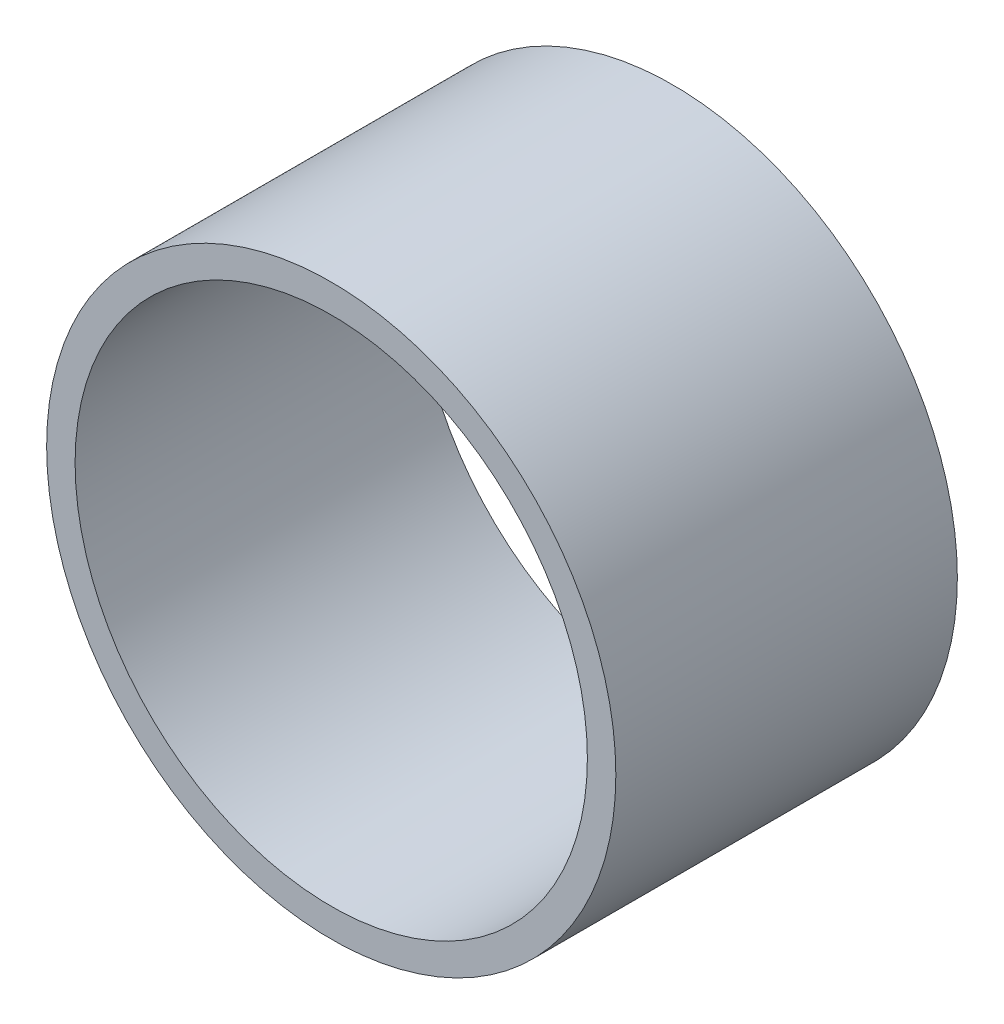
from build123d import *

# Parameters (mm, degrees)
SKETCH1_R           = 250
SKETCH1_R_2         = 225
BOSS_EXTRUDE1_DEPTH = 300


with BuildPart() as part:
    # Sketch1 → Boss-Extrude1 (new body)
    with BuildSketch(Plane.XY):
        Circle(SKETCH1_R)
        Circle(SKETCH1_R_2, mode=Mode.SUBTRACT)
    extrude(amount=BOSS_EXTRUDE1_DEPTH)


solid = part.part
